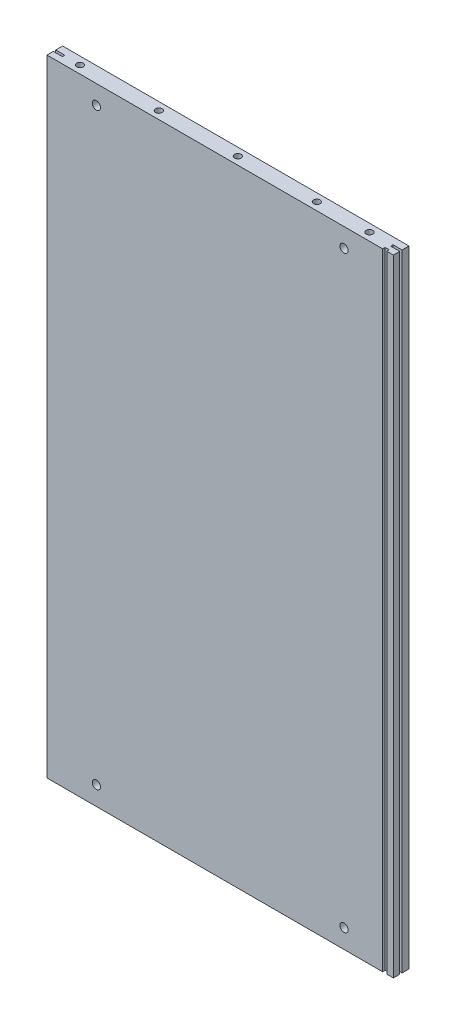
ISO-10303-21;
HEADER;
FILE_DESCRIPTION(('STEP AP214'),'2;1');
FILE_NAME('part.step','',(''),(''),'','','');
FILE_SCHEMA(('AUTOMOTIVE_DESIGN { 1 0 10303 214 1 1 1 1 }'));
ENDSEC;
DATA;
#1=APPLICATION_CONTEXT('core data for automotive mechanical design processes');
#2=APPLICATION_PROTOCOL_DEFINITION('international standard','automotive_design',2000,#1);
#3=PRODUCT_CONTEXT('',#1,'mechanical');
#4=PRODUCT('Part','Part','',(#3));
#5=PRODUCT_RELATED_PRODUCT_CATEGORY('part','',(#4));
#6=PRODUCT_DEFINITION_FORMATION('','',#4);
#7=PRODUCT_DEFINITION_CONTEXT('part definition',#1,'design');
#8=PRODUCT_DEFINITION('design','',#6,#7);
#9=PRODUCT_DEFINITION_SHAPE('','',#8);
#10=(LENGTH_UNIT() NAMED_UNIT(*) SI_UNIT(.MILLI.,.METRE.));
#11=(NAMED_UNIT(*) PLANE_ANGLE_UNIT() SI_UNIT($,.RADIAN.));
#12=(NAMED_UNIT(*) SI_UNIT($,.STERADIAN.) SOLID_ANGLE_UNIT());
#13=UNCERTAINTY_MEASURE_WITH_UNIT(LENGTH_MEASURE(1.E-05),#10,'distance_accuracy_value','');
#14=(GEOMETRIC_REPRESENTATION_CONTEXT(3) GLOBAL_UNCERTAINTY_ASSIGNED_CONTEXT((#13)) GLOBAL_UNIT_ASSIGNED_CONTEXT((#10,
#11,#12)) REPRESENTATION_CONTEXT('',''));
#15=CARTESIAN_POINT('',(0.,0.,0.));
#16=DIRECTION('',(0.,0.,1.));
#17=DIRECTION('',(1.,0.,0.));
#18=AXIS2_PLACEMENT_3D('',#15,#16,#17);
#19=CARTESIAN_POINT('',(-210.5,-380.5,19.));
#20=DIRECTION('',(1.,0.,0.));
#21=DIRECTION('',(0.,0.,-1.));
#22=AXIS2_PLACEMENT_3D('',#19,#20,#21);
#23=PLANE('',#22);
#24=DIRECTION('',(0.,0.,-1.));
#25=VECTOR('',#24,1.);
#26=CARTESIAN_POINT('',(-210.5,-380.5,19.));
#27=LINE('',#26,#25);
#28=CARTESIAN_POINT('',(-210.5,-380.5,8.4));
#29=VERTEX_POINT('',#28);
#30=CARTESIAN_POINT('',(-210.5,-380.5,0.));
#31=VERTEX_POINT('',#30);
#32=EDGE_CURVE('E190',#29,#31,#27,.T.);
#33=ORIENTED_EDGE('',*,*,#32,.F.);
#34=DIRECTION('',(0.,1.,0.));
#35=VECTOR('',#34,1.);
#36=CARTESIAN_POINT('',(-210.5,-380.5,8.4));
#37=LINE('',#36,#35);
#38=CARTESIAN_POINT('',(-210.5,380.5,8.4));
#39=VERTEX_POINT('',#38);
#40=EDGE_CURVE('E176',#29,#39,#37,.T.);
#41=ORIENTED_EDGE('',*,*,#40,.T.);
#42=DIRECTION('',(0.,0.,-1.));
#43=VECTOR('',#42,1.);
#44=CARTESIAN_POINT('',(-210.5,380.5,19.));
#45=LINE('',#44,#43);
#46=CARTESIAN_POINT('',(-210.5,380.5,0.));
#47=VERTEX_POINT('',#46);
#48=EDGE_CURVE('E203',#39,#47,#45,.T.);
#49=ORIENTED_EDGE('',*,*,#48,.T.);
#50=DIRECTION('',(0.,-1.,0.));
#51=VECTOR('',#50,1.);
#52=CARTESIAN_POINT('',(-210.5,-380.5,0.));
#53=LINE('',#52,#51);
#54=EDGE_CURVE('E197',#47,#31,#53,.T.);
#55=ORIENTED_EDGE('',*,*,#54,.T.);
#56=EDGE_LOOP('',(#33,#41,#49,#55));
#57=FACE_BOUND('',#56,.T.);
#58=ADVANCED_FACE('F33',(#57),#23,.F.);
#59=CARTESIAN_POINT('',(210.5,-380.5,19.));
#60=DIRECTION('',(-1.,0.,0.));
#61=DIRECTION('',(0.,0.,1.));
#62=AXIS2_PLACEMENT_3D('',#59,#60,#61);
#63=PLANE('',#62);
#64=DIRECTION('',(0.,0.,-1.));
#65=VECTOR('',#64,1.);
#66=CARTESIAN_POINT('',(210.5,-380.5,19.));
#67=LINE('',#66,#65);
#68=CARTESIAN_POINT('',(210.5,-380.5,19.));
#69=VERTEX_POINT('',#68);
#70=CARTESIAN_POINT('',(210.5,-380.5,11.3));
#71=VERTEX_POINT('',#70);
#72=EDGE_CURVE('E200',#69,#71,#67,.T.);
#73=ORIENTED_EDGE('',*,*,#72,.T.);
#74=DIRECTION('',(0.,1.,0.));
#75=VECTOR('',#74,1.);
#76=CARTESIAN_POINT('',(210.5,-380.5,11.3));
#77=LINE('',#76,#75);
#78=CARTESIAN_POINT('',(210.5,380.5,11.3));
#79=VERTEX_POINT('',#78);
#80=EDGE_CURVE('E354',#71,#79,#77,.T.);
#81=ORIENTED_EDGE('',*,*,#80,.T.);
#82=DIRECTION('',(0.,0.,-1.));
#83=VECTOR('',#82,1.);
#84=CARTESIAN_POINT('',(210.5,380.5,19.));
#85=LINE('',#84,#83);
#86=CARTESIAN_POINT('',(210.5,380.5,19.));
#87=VERTEX_POINT('',#86);
#88=EDGE_CURVE('E11',#87,#79,#85,.T.);
#89=ORIENTED_EDGE('',*,*,#88,.F.);
#90=DIRECTION('',(0.,1.,0.));
#91=VECTOR('',#90,1.);
#92=CARTESIAN_POINT('',(210.5,-380.5,19.));
#93=LINE('',#92,#91);
#94=EDGE_CURVE('E229',#69,#87,#93,.T.);
#95=ORIENTED_EDGE('',*,*,#94,.F.);
#96=EDGE_LOOP('',(#73,#81,#89,#95));
#97=FACE_BOUND('',#96,.T.);
#98=ADVANCED_FACE('F414',(#97),#63,.F.);
#99=CARTESIAN_POINT('',(0.,0.,19.));
#100=DIRECTION('',(0.,0.,-1.));
#101=DIRECTION('',(-1.,0.,0.));
#102=AXIS2_PLACEMENT_3D('',#99,#100,#101);
#103=PLANE('',#102);
#104=DIRECTION('',(-1.,0.,0.));
#105=VECTOR('',#104,1.);
#106=CARTESIAN_POINT('',(-210.5,380.5,19.));
#107=LINE('',#106,#105);
#108=CARTESIAN_POINT('',(202.5,380.5,19.));
#109=VERTEX_POINT('',#108);
#110=EDGE_CURVE('E239',#87,#109,#107,.T.);
#111=ORIENTED_EDGE('',*,*,#110,.T.);
#112=DIRECTION('',(0.,-1.,0.));
#113=VECTOR('',#112,1.);
#114=CARTESIAN_POINT('',(202.5,380.5,19.));
#115=LINE('',#114,#113);
#116=CARTESIAN_POINT('',(202.5,-380.5,19.));
#117=VERTEX_POINT('',#116);
#118=EDGE_CURVE('E232',#109,#117,#115,.T.);
#119=ORIENTED_EDGE('',*,*,#118,.T.);
#120=DIRECTION('',(1.,0.,0.));
#121=VECTOR('',#120,1.);
#122=CARTESIAN_POINT('',(-210.5,-380.5,19.));
#123=LINE('',#122,#121);
#124=EDGE_CURVE('E236',#117,#69,#123,.T.);
#125=ORIENTED_EDGE('',*,*,#124,.T.);
#126=ORIENTED_EDGE('',*,*,#94,.T.);
#127=EDGE_LOOP('',(#111,#119,#125,#126));
#128=FACE_BOUND('',#127,.T.);
#129=ADVANCED_FACE('F419',(#128),#103,.F.);
#130=CARTESIAN_POINT('',(210.5,380.5,8.4));
#131=VERTEX_POINT('',#130);
#132=CARTESIAN_POINT('',(210.5,380.5,0.));
#133=VERTEX_POINT('',#132);
#134=EDGE_CURVE('E41',#131,#133,#85,.T.);
#135=ORIENTED_EDGE('',*,*,#134,.F.);
#136=DIRECTION('',(0.,1.,0.));
#137=VECTOR('',#136,1.);
#138=CARTESIAN_POINT('',(210.5,-380.5,8.4));
#139=LINE('',#138,#137);
#140=CARTESIAN_POINT('',(210.5,-380.5,8.4));
#141=VERTEX_POINT('',#140);
#142=EDGE_CURVE('E355',#141,#131,#139,.T.);
#143=ORIENTED_EDGE('',*,*,#142,.F.);
#144=CARTESIAN_POINT('',(210.5,-380.5,0.));
#145=VERTEX_POINT('',#144);
#146=EDGE_CURVE('E205',#141,#145,#67,.T.);
#147=ORIENTED_EDGE('',*,*,#146,.T.);
#148=DIRECTION('',(0.,1.,0.));
#149=VECTOR('',#148,1.);
#150=CARTESIAN_POINT('',(210.5,-380.5,0.));
#151=LINE('',#150,#149);
#152=EDGE_CURVE('E224',#145,#133,#151,.T.);
#153=ORIENTED_EDGE('',*,*,#152,.T.);
#154=EDGE_LOOP('',(#135,#143,#147,#153));
#155=FACE_BOUND('',#154,.T.);
#156=ADVANCED_FACE('F35',(#155),#63,.F.);
#157=CARTESIAN_POINT('',(-210.5,380.5,19.));
#158=DIRECTION('',(0.,-1.,0.));
#159=DIRECTION('',(0.,0.,-1.));
#160=AXIS2_PLACEMENT_3D('',#157,#158,#159);
#161=PLANE('',#160);
#162=CARTESIAN_POINT('',(172.,380.5,9.5));
#163=DIRECTION('',(0.,1.,0.));
#164=DIRECTION('',(0.,0.,1.));
#165=AXIS2_PLACEMENT_3D('',#162,#163,#164);
#166=CIRCLE('',#165,3.99999999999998);
#167=CARTESIAN_POINT('',(172.,380.5,13.5));
#168=VERTEX_POINT('',#167);
#169=EDGE_CURVE('E327',#168,#168,#166,.T.);
#170=ORIENTED_EDGE('',*,*,#169,.F.);
#171=EDGE_LOOP('',(#170));
#172=FACE_BOUND('',#171,.T.);
#173=CARTESIAN_POINT('',(108.,380.5,9.5));
#174=DIRECTION('',(0.,1.,0.));
#175=DIRECTION('',(0.,0.,1.));
#176=AXIS2_PLACEMENT_3D('',#173,#174,#175);
#177=CIRCLE('',#176,3.99999999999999);
#178=CARTESIAN_POINT('',(108.,380.5,13.5));
#179=VERTEX_POINT('',#178);
#180=EDGE_CURVE('E321',#179,#179,#177,.T.);
#181=ORIENTED_EDGE('',*,*,#180,.F.);
#182=EDGE_LOOP('',(#181));
#183=FACE_BOUND('',#182,.T.);
#184=CARTESIAN_POINT('',(12.,380.5,9.5));
#185=DIRECTION('',(0.,1.,0.));
#186=DIRECTION('',(0.,0.,1.));
#187=AXIS2_PLACEMENT_3D('',#184,#185,#186);
#188=CIRCLE('',#187,3.99999999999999);
#189=CARTESIAN_POINT('',(12.,380.5,13.5));
#190=VERTEX_POINT('',#189);
#191=EDGE_CURVE('E315',#190,#190,#188,.T.);
#192=ORIENTED_EDGE('',*,*,#191,.F.);
#193=EDGE_LOOP('',(#192));
#194=FACE_BOUND('',#193,.T.);
#195=CARTESIAN_POINT('',(-84.,380.5,9.5));
#196=DIRECTION('',(0.,1.,0.));
#197=DIRECTION('',(0.,0.,1.));
#198=AXIS2_PLACEMENT_3D('',#195,#196,#197);
#199=CIRCLE('',#198,3.99999999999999);
#200=CARTESIAN_POINT('',(-84.,380.5,13.5));
#201=VERTEX_POINT('',#200);
#202=EDGE_CURVE('E309',#201,#201,#199,.T.);
#203=ORIENTED_EDGE('',*,*,#202,.F.);
#204=EDGE_LOOP('',(#203));
#205=FACE_BOUND('',#204,.T.);
#206=CARTESIAN_POINT('',(-180.,380.5,9.5));
#207=DIRECTION('',(0.,1.,0.));
#208=DIRECTION('',(0.,0.,1.));
#209=AXIS2_PLACEMENT_3D('',#206,#207,#208);
#210=CIRCLE('',#209,4.);
#211=CARTESIAN_POINT('',(-180.,380.5,13.5));
#212=VERTEX_POINT('',#211);
#213=EDGE_CURVE('E303',#212,#212,#210,.T.);
#214=ORIENTED_EDGE('',*,*,#213,.F.);
#215=EDGE_LOOP('',(#214));
#216=FACE_BOUND('',#215,.T.);
#217=ORIENTED_EDGE('',*,*,#48,.F.);
#218=DIRECTION('',(-1.,0.,0.));
#219=VECTOR('',#218,1.);
#220=CARTESIAN_POINT('',(-199.5,380.5,8.4));
#221=LINE('',#220,#219);
#222=CARTESIAN_POINT('',(-199.5,380.5,8.4));
#223=VERTEX_POINT('',#222);
#224=EDGE_CURVE('E181',#223,#39,#221,.T.);
#225=ORIENTED_EDGE('',*,*,#224,.F.);
#226=DIRECTION('',(0.,0.,-1.));
#227=VECTOR('',#226,1.);
#228=CARTESIAN_POINT('',(-199.5,380.5,11.3));
#229=LINE('',#228,#227);
#230=CARTESIAN_POINT('',(-199.5,380.5,11.3));
#231=VERTEX_POINT('',#230);
#232=EDGE_CURVE('E194',#231,#223,#229,.T.);
#233=ORIENTED_EDGE('',*,*,#232,.F.);
#234=DIRECTION('',(1.,0.,0.));
#235=VECTOR('',#234,1.);
#236=CARTESIAN_POINT('',(-210.5,380.5,11.3));
#237=LINE('',#236,#235);
#238=CARTESIAN_POINT('',(-210.5,380.5,11.3));
#239=VERTEX_POINT('',#238);
#240=EDGE_CURVE('E385',#239,#231,#237,.T.);
#241=ORIENTED_EDGE('',*,*,#240,.F.);
#242=CARTESIAN_POINT('',(-210.5,380.5,19.));
#243=VERTEX_POINT('',#242);
#244=EDGE_CURVE('E208',#243,#239,#45,.T.);
#245=ORIENTED_EDGE('',*,*,#244,.F.);
#246=CARTESIAN_POINT('',(197.5,380.5,19.));
#247=VERTEX_POINT('',#246);
#248=EDGE_CURVE('E242',#247,#243,#107,.T.);
#249=ORIENTED_EDGE('',*,*,#248,.F.);
#250=DIRECTION('',(0.,0.,-1.));
#251=VECTOR('',#250,1.);
#252=CARTESIAN_POINT('',(197.5,380.5,19.));
#253=LINE('',#252,#251);
#254=CARTESIAN_POINT('',(197.5,380.5,16.));
#255=VERTEX_POINT('',#254);
#256=EDGE_CURVE('E256',#247,#255,#253,.T.);
#257=ORIENTED_EDGE('',*,*,#256,.T.);
#258=DIRECTION('',(1.,0.,0.));
#259=VECTOR('',#258,1.);
#260=CARTESIAN_POINT('',(197.5,380.5,16.));
#261=LINE('',#260,#259);
#262=CARTESIAN_POINT('',(202.5,380.5,16.));
#263=VERTEX_POINT('',#262);
#264=EDGE_CURVE('E266',#255,#263,#261,.T.);
#265=ORIENTED_EDGE('',*,*,#264,.T.);
#266=DIRECTION('',(0.,0.,1.));
#267=VECTOR('',#266,1.);
#268=CARTESIAN_POINT('',(202.5,380.5,16.));
#269=LINE('',#268,#267);
#270=EDGE_CURVE('E248',#263,#109,#269,.T.);
#271=ORIENTED_EDGE('',*,*,#270,.T.);
#272=ORIENTED_EDGE('',*,*,#110,.F.);
#273=ORIENTED_EDGE('',*,*,#88,.T.);
#274=DIRECTION('',(1.,0.,0.));
#275=VECTOR('',#274,1.);
#276=CARTESIAN_POINT('',(210.5,380.5,11.3));
#277=LINE('',#276,#275);
#278=CARTESIAN_POINT('',(199.5,380.5,11.3));
#279=VERTEX_POINT('',#278);
#280=EDGE_CURVE('E364',#279,#79,#277,.T.);
#281=ORIENTED_EDGE('',*,*,#280,.F.);
#282=DIRECTION('',(0.,0.,1.));
#283=VECTOR('',#282,1.);
#284=CARTESIAN_POINT('',(199.5,380.5,11.3));
#285=LINE('',#284,#283);
#286=CARTESIAN_POINT('',(199.5,380.5,8.4));
#287=VERTEX_POINT('',#286);
#288=EDGE_CURVE('E367',#287,#279,#285,.T.);
#289=ORIENTED_EDGE('',*,*,#288,.F.);
#290=DIRECTION('',(-1.,0.,0.));
#291=VECTOR('',#290,1.);
#292=CARTESIAN_POINT('',(199.5,380.5,8.4));
#293=LINE('',#292,#291);
#294=EDGE_CURVE('E370',#131,#287,#293,.T.);
#295=ORIENTED_EDGE('',*,*,#294,.F.);
#296=ORIENTED_EDGE('',*,*,#134,.T.);
#297=DIRECTION('',(-1.,0.,0.));
#298=VECTOR('',#297,1.);
#299=CARTESIAN_POINT('',(-210.5,380.5,0.));
#300=LINE('',#299,#298);
#301=EDGE_CURVE('E217',#133,#47,#300,.T.);
#302=ORIENTED_EDGE('',*,*,#301,.T.);
#303=EDGE_LOOP('',(#217,#225,#233,#241,#245,#249,#257,#265,#271,#272,#273,#281,#289,#295,#296,#302));
#304=FACE_BOUND('',#303,.T.);
#305=ADVANCED_FACE('F218',(#172,#183,#194,#205,#216,#304),#161,.F.);
#306=ORIENTED_EDGE('',*,*,#244,.T.);
#307=DIRECTION('',(0.,1.,0.));
#308=VECTOR('',#307,1.);
#309=CARTESIAN_POINT('',(-210.5,-380.5,11.3));
#310=LINE('',#309,#308);
#311=CARTESIAN_POINT('',(-210.5,-380.5,11.3));
#312=VERTEX_POINT('',#311);
#313=EDGE_CURVE('E185',#312,#239,#310,.T.);
#314=ORIENTED_EDGE('',*,*,#313,.F.);
#315=CARTESIAN_POINT('',(-210.5,-380.5,19.));
#316=VERTEX_POINT('',#315);
#317=EDGE_CURVE('E199',#316,#312,#27,.T.);
#318=ORIENTED_EDGE('',*,*,#317,.F.);
#319=DIRECTION('',(0.,-1.,0.));
#320=VECTOR('',#319,1.);
#321=CARTESIAN_POINT('',(-210.5,-380.5,19.));
#322=LINE('',#321,#320);
#323=EDGE_CURVE('E237',#243,#316,#322,.T.);
#324=ORIENTED_EDGE('',*,*,#323,.F.);
#325=EDGE_LOOP('',(#306,#314,#318,#324));
#326=FACE_BOUND('',#325,.T.);
#327=ADVANCED_FACE('F395',(#326),#23,.F.);
#328=CARTESIAN_POINT('',(-210.5,-380.5,19.));
#329=DIRECTION('',(0.,1.,0.));
#330=DIRECTION('',(0.,0.,1.));
#331=AXIS2_PLACEMENT_3D('',#328,#329,#330);
#332=PLANE('',#331);
#333=CARTESIAN_POINT('',(172.,-380.5,9.5));
#334=DIRECTION('',(0.,-1.,0.));
#335=DIRECTION('',(0.,0.,-1.));
#336=AXIS2_PLACEMENT_3D('',#333,#334,#335);
#337=CIRCLE('',#336,3.99999999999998);
#338=CARTESIAN_POINT('',(172.,-380.5,5.50000000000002));
#339=VERTEX_POINT('',#338);
#340=EDGE_CURVE('E297',#339,#339,#337,.T.);
#341=ORIENTED_EDGE('',*,*,#340,.F.);
#342=EDGE_LOOP('',(#341));
#343=FACE_BOUND('',#342,.T.);
#344=CARTESIAN_POINT('',(108.,-380.5,9.5));
#345=DIRECTION('',(0.,-1.,0.));
#346=DIRECTION('',(0.,0.,-1.));
#347=AXIS2_PLACEMENT_3D('',#344,#345,#346);
#348=CIRCLE('',#347,3.99999999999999);
#349=CARTESIAN_POINT('',(108.,-380.5,5.50000000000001));
#350=VERTEX_POINT('',#349);
#351=EDGE_CURVE('E291',#350,#350,#348,.T.);
#352=ORIENTED_EDGE('',*,*,#351,.F.);
#353=EDGE_LOOP('',(#352));
#354=FACE_BOUND('',#353,.T.);
#355=CARTESIAN_POINT('',(12.,-380.5,9.5));
#356=DIRECTION('',(0.,-1.,0.));
#357=DIRECTION('',(0.,0.,-1.));
#358=AXIS2_PLACEMENT_3D('',#355,#356,#357);
#359=CIRCLE('',#358,3.99999999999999);
#360=CARTESIAN_POINT('',(12.,-380.5,5.50000000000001));
#361=VERTEX_POINT('',#360);
#362=EDGE_CURVE('E285',#361,#361,#359,.T.);
#363=ORIENTED_EDGE('',*,*,#362,.F.);
#364=EDGE_LOOP('',(#363));
#365=FACE_BOUND('',#364,.T.);
#366=CARTESIAN_POINT('',(-84.,-380.5,9.5));
#367=DIRECTION('',(0.,-1.,0.));
#368=DIRECTION('',(0.,0.,-1.));
#369=AXIS2_PLACEMENT_3D('',#366,#367,#368);
#370=CIRCLE('',#369,3.99999999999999);
#371=CARTESIAN_POINT('',(-84.,-380.5,5.50000000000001));
#372=VERTEX_POINT('',#371);
#373=EDGE_CURVE('E279',#372,#372,#370,.T.);
#374=ORIENTED_EDGE('',*,*,#373,.F.);
#375=EDGE_LOOP('',(#374));
#376=FACE_BOUND('',#375,.T.);
#377=CARTESIAN_POINT('',(-180.,-380.5,9.5));
#378=DIRECTION('',(0.,-1.,0.));
#379=DIRECTION('',(0.,0.,-1.));
#380=AXIS2_PLACEMENT_3D('',#377,#378,#379);
#381=CIRCLE('',#380,4.);
#382=CARTESIAN_POINT('',(-180.,-380.5,5.5));
#383=VERTEX_POINT('',#382);
#384=EDGE_CURVE('E273',#383,#383,#381,.T.);
#385=ORIENTED_EDGE('',*,*,#384,.F.);
#386=EDGE_LOOP('',(#385));
#387=FACE_BOUND('',#386,.T.);
#388=DIRECTION('',(0.,0.,-1.));
#389=VECTOR('',#388,1.);
#390=CARTESIAN_POINT('',(-199.5,-380.5,11.3));
#391=LINE('',#390,#389);
#392=CARTESIAN_POINT('',(-199.5,-380.5,11.3));
#393=VERTEX_POINT('',#392);
#394=CARTESIAN_POINT('',(-199.5,-380.5,8.4));
#395=VERTEX_POINT('',#394);
#396=EDGE_CURVE('E48',#393,#395,#391,.T.);
#397=ORIENTED_EDGE('',*,*,#396,.T.);
#398=DIRECTION('',(-1.,0.,0.));
#399=VECTOR('',#398,1.);
#400=CARTESIAN_POINT('',(-199.5,-380.5,8.4));
#401=LINE('',#400,#399);
#402=EDGE_CURVE('E179',#395,#29,#401,.T.);
#403=ORIENTED_EDGE('',*,*,#402,.T.);
#404=ORIENTED_EDGE('',*,*,#32,.T.);
#405=DIRECTION('',(1.,0.,0.));
#406=VECTOR('',#405,1.);
#407=CARTESIAN_POINT('',(-210.5,-380.5,0.));
#408=LINE('',#407,#406);
#409=EDGE_CURVE('E227',#31,#145,#408,.T.);
#410=ORIENTED_EDGE('',*,*,#409,.T.);
#411=ORIENTED_EDGE('',*,*,#146,.F.);
#412=DIRECTION('',(-1.,0.,0.));
#413=VECTOR('',#412,1.);
#414=CARTESIAN_POINT('',(199.5,-380.5,8.4));
#415=LINE('',#414,#413);
#416=CARTESIAN_POINT('',(199.5,-380.5,8.4));
#417=VERTEX_POINT('',#416);
#418=EDGE_CURVE('E366',#141,#417,#415,.T.);
#419=ORIENTED_EDGE('',*,*,#418,.T.);
#420=DIRECTION('',(0.,0.,1.));
#421=VECTOR('',#420,1.);
#422=CARTESIAN_POINT('',(199.5,-380.5,11.3));
#423=LINE('',#422,#421);
#424=CARTESIAN_POINT('',(199.5,-380.5,11.3));
#425=VERTEX_POINT('',#424);
#426=EDGE_CURVE('E56',#417,#425,#423,.T.);
#427=ORIENTED_EDGE('',*,*,#426,.T.);
#428=DIRECTION('',(1.,0.,0.));
#429=VECTOR('',#428,1.);
#430=CARTESIAN_POINT('',(210.5,-380.5,11.3));
#431=LINE('',#430,#429);
#432=EDGE_CURVE('E358',#425,#71,#431,.T.);
#433=ORIENTED_EDGE('',*,*,#432,.T.);
#434=ORIENTED_EDGE('',*,*,#72,.F.);
#435=ORIENTED_EDGE('',*,*,#124,.F.);
#436=DIRECTION('',(0.,0.,1.));
#437=VECTOR('',#436,1.);
#438=CARTESIAN_POINT('',(202.5,-380.5,16.));
#439=LINE('',#438,#437);
#440=CARTESIAN_POINT('',(202.5,-380.5,16.));
#441=VERTEX_POINT('',#440);
#442=EDGE_CURVE('E254',#441,#117,#439,.T.);
#443=ORIENTED_EDGE('',*,*,#442,.F.);
#444=DIRECTION('',(1.,0.,0.));
#445=VECTOR('',#444,1.);
#446=CARTESIAN_POINT('',(197.5,-380.5,16.));
#447=LINE('',#446,#445);
#448=CARTESIAN_POINT('',(197.5,-380.5,16.));
#449=VERTEX_POINT('',#448);
#450=EDGE_CURVE('E257',#449,#441,#447,.T.);
#451=ORIENTED_EDGE('',*,*,#450,.F.);
#452=DIRECTION('',(0.,0.,-1.));
#453=VECTOR('',#452,1.);
#454=CARTESIAN_POINT('',(197.5,-380.5,19.));
#455=LINE('',#454,#453);
#456=CARTESIAN_POINT('',(197.5,-380.5,19.));
#457=VERTEX_POINT('',#456);
#458=EDGE_CURVE('E260',#457,#449,#455,.T.);
#459=ORIENTED_EDGE('',*,*,#458,.F.);
#460=EDGE_CURVE('E233',#316,#457,#123,.T.);
#461=ORIENTED_EDGE('',*,*,#460,.F.);
#462=ORIENTED_EDGE('',*,*,#317,.T.);
#463=DIRECTION('',(1.,0.,0.));
#464=VECTOR('',#463,1.);
#465=CARTESIAN_POINT('',(-210.5,-380.5,11.3));
#466=LINE('',#465,#464);
#467=EDGE_CURVE('E193',#312,#393,#466,.T.);
#468=ORIENTED_EDGE('',*,*,#467,.T.);
#469=EDGE_LOOP('',(#397,#403,#404,#410,#411,#419,#427,#433,#434,#435,#443,#451,#459,#461,#462,#468));
#470=FACE_BOUND('',#469,.T.);
#471=ADVANCED_FACE('F188',(#343,#354,#365,#376,#387,#470),#332,.F.);
#472=CARTESIAN_POINT('',(-150.5,357.5,19.));
#473=DIRECTION('',(0.,0.,1.));
#474=DIRECTION('',(1.,0.,0.));
#475=AXIS2_PLACEMENT_3D('',#472,#473,#474);
#476=CIRCLE('',#475,4.99999999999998);
#477=CARTESIAN_POINT('',(-145.5,357.5,19.));
#478=VERTEX_POINT('',#477);
#479=EDGE_CURVE('E351',#478,#478,#476,.T.);
#480=ORIENTED_EDGE('',*,*,#479,.F.);
#481=EDGE_LOOP('',(#480));
#482=FACE_BOUND('',#481,.T.);
#483=CARTESIAN_POINT('',(150.5,357.5,19.));
#484=DIRECTION('',(0.,0.,1.));
#485=DIRECTION('',(1.,0.,0.));
#486=AXIS2_PLACEMENT_3D('',#483,#484,#485);
#487=CIRCLE('',#486,4.99999999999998);
#488=CARTESIAN_POINT('',(155.5,357.5,19.));
#489=VERTEX_POINT('',#488);
#490=EDGE_CURVE('E345',#489,#489,#487,.T.);
#491=ORIENTED_EDGE('',*,*,#490,.F.);
#492=EDGE_LOOP('',(#491));
#493=FACE_BOUND('',#492,.T.);
#494=CARTESIAN_POINT('',(150.5,-357.5,19.));
#495=DIRECTION('',(0.,0.,1.));
#496=DIRECTION('',(1.,0.,0.));
#497=AXIS2_PLACEMENT_3D('',#494,#495,#496);
#498=CIRCLE('',#497,4.99999999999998);
#499=CARTESIAN_POINT('',(155.5,-357.5,19.));
#500=VERTEX_POINT('',#499);
#501=EDGE_CURVE('E339',#500,#500,#498,.T.);
#502=ORIENTED_EDGE('',*,*,#501,.F.);
#503=EDGE_LOOP('',(#502));
#504=FACE_BOUND('',#503,.T.);
#505=CARTESIAN_POINT('',(-150.5,-357.5,19.));
#506=DIRECTION('',(0.,0.,1.));
#507=DIRECTION('',(1.,0.,0.));
#508=AXIS2_PLACEMENT_3D('',#505,#506,#507);
#509=CIRCLE('',#508,4.99999999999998);
#510=CARTESIAN_POINT('',(-145.5,-357.5,19.));
#511=VERTEX_POINT('',#510);
#512=EDGE_CURVE('E333',#511,#511,#509,.T.);
#513=ORIENTED_EDGE('',*,*,#512,.F.);
#514=EDGE_LOOP('',(#513));
#515=FACE_BOUND('',#514,.T.);
#516=ORIENTED_EDGE('',*,*,#460,.T.);
#517=DIRECTION('',(0.,-1.,0.));
#518=VECTOR('',#517,1.);
#519=CARTESIAN_POINT('',(197.5,380.5,19.));
#520=LINE('',#519,#518);
#521=EDGE_CURVE('E245',#247,#457,#520,.T.);
#522=ORIENTED_EDGE('',*,*,#521,.F.);
#523=ORIENTED_EDGE('',*,*,#248,.T.);
#524=ORIENTED_EDGE('',*,*,#323,.T.);
#525=EDGE_LOOP('',(#516,#522,#523,#524));
#526=FACE_BOUND('',#525,.T.);
#527=ADVANCED_FACE('F400',(#482,#493,#504,#515,#526),#103,.F.);
#528=CARTESIAN_POINT('',(0.,0.,0.));
#529=DIRECTION('',(0.,0.,-1.));
#530=DIRECTION('',(-1.,0.,0.));
#531=AXIS2_PLACEMENT_3D('',#528,#529,#530);
#532=PLANE('',#531);
#533=CARTESIAN_POINT('',(-150.5,357.5,0.));
#534=DIRECTION('',(0.,0.,1.));
#535=DIRECTION('',(1.,0.,0.));
#536=AXIS2_PLACEMENT_3D('',#533,#534,#535);
#537=CIRCLE('',#536,5.);
#538=CARTESIAN_POINT('',(-145.5,357.5,0.));
#539=VERTEX_POINT('',#538);
#540=EDGE_CURVE('E348',#539,#539,#537,.T.);
#541=ORIENTED_EDGE('',*,*,#540,.T.);
#542=EDGE_LOOP('',(#541));
#543=FACE_BOUND('',#542,.T.);
#544=CARTESIAN_POINT('',(150.5,357.5,0.));
#545=DIRECTION('',(0.,0.,1.));
#546=DIRECTION('',(1.,0.,0.));
#547=AXIS2_PLACEMENT_3D('',#544,#545,#546);
#548=CIRCLE('',#547,5.);
#549=CARTESIAN_POINT('',(155.5,357.5,0.));
#550=VERTEX_POINT('',#549);
#551=EDGE_CURVE('E342',#550,#550,#548,.T.);
#552=ORIENTED_EDGE('',*,*,#551,.T.);
#553=EDGE_LOOP('',(#552));
#554=FACE_BOUND('',#553,.T.);
#555=CARTESIAN_POINT('',(150.5,-357.5,0.));
#556=DIRECTION('',(0.,0.,1.));
#557=DIRECTION('',(1.,0.,0.));
#558=AXIS2_PLACEMENT_3D('',#555,#556,#557);
#559=CIRCLE('',#558,5.);
#560=CARTESIAN_POINT('',(155.5,-357.5,0.));
#561=VERTEX_POINT('',#560);
#562=EDGE_CURVE('E336',#561,#561,#559,.T.);
#563=ORIENTED_EDGE('',*,*,#562,.T.);
#564=EDGE_LOOP('',(#563));
#565=FACE_BOUND('',#564,.T.);
#566=CARTESIAN_POINT('',(-150.5,-357.5,0.));
#567=DIRECTION('',(0.,0.,1.));
#568=DIRECTION('',(1.,0.,0.));
#569=AXIS2_PLACEMENT_3D('',#566,#567,#568);
#570=CIRCLE('',#569,5.);
#571=CARTESIAN_POINT('',(-145.5,-357.5,0.));
#572=VERTEX_POINT('',#571);
#573=EDGE_CURVE('E330',#572,#572,#570,.T.);
#574=ORIENTED_EDGE('',*,*,#573,.T.);
#575=EDGE_LOOP('',(#574));
#576=FACE_BOUND('',#575,.T.);
#577=ORIENTED_EDGE('',*,*,#152,.F.);
#578=ORIENTED_EDGE('',*,*,#409,.F.);
#579=ORIENTED_EDGE('',*,*,#54,.F.);
#580=ORIENTED_EDGE('',*,*,#301,.F.);
#581=EDGE_LOOP('',(#577,#578,#579,#580));
#582=FACE_BOUND('',#581,.T.);
#583=ADVANCED_FACE('F226',(#543,#554,#565,#576,#582),#532,.T.);
#584=CARTESIAN_POINT('',(202.5,380.5,16.));
#585=DIRECTION('',(1.,0.,0.));
#586=DIRECTION('',(0.,0.,-1.));
#587=AXIS2_PLACEMENT_3D('',#584,#585,#586);
#588=PLANE('',#587);
#589=ORIENTED_EDGE('',*,*,#442,.T.);
#590=ORIENTED_EDGE('',*,*,#118,.F.);
#591=ORIENTED_EDGE('',*,*,#270,.F.);
#592=DIRECTION('',(0.,-1.,0.));
#593=VECTOR('',#592,1.);
#594=CARTESIAN_POINT('',(202.5,380.5,16.));
#595=LINE('',#594,#593);
#596=EDGE_CURVE('E250',#263,#441,#595,.T.);
#597=ORIENTED_EDGE('',*,*,#596,.T.);
#598=EDGE_LOOP('',(#589,#590,#591,#597));
#599=FACE_BOUND('',#598,.T.);
#600=ADVANCED_FACE('F502',(#599),#588,.F.);
#601=CARTESIAN_POINT('',(197.5,380.5,16.));
#602=DIRECTION('',(0.,0.,-1.));
#603=DIRECTION('',(-1.,0.,0.));
#604=AXIS2_PLACEMENT_3D('',#601,#602,#603);
#605=PLANE('',#604);
#606=ORIENTED_EDGE('',*,*,#450,.T.);
#607=ORIENTED_EDGE('',*,*,#596,.F.);
#608=ORIENTED_EDGE('',*,*,#264,.F.);
#609=DIRECTION('',(0.,-1.,0.));
#610=VECTOR('',#609,1.);
#611=CARTESIAN_POINT('',(197.5,380.5,16.));
#612=LINE('',#611,#610);
#613=EDGE_CURVE('E247',#255,#449,#612,.T.);
#614=ORIENTED_EDGE('',*,*,#613,.T.);
#615=EDGE_LOOP('',(#606,#607,#608,#614));
#616=FACE_BOUND('',#615,.T.);
#617=ADVANCED_FACE('F505',(#616),#605,.F.);
#618=CARTESIAN_POINT('',(197.5,380.5,19.));
#619=DIRECTION('',(-1.,0.,0.));
#620=DIRECTION('',(0.,0.,1.));
#621=AXIS2_PLACEMENT_3D('',#618,#619,#620);
#622=PLANE('',#621);
#623=ORIENTED_EDGE('',*,*,#458,.T.);
#624=ORIENTED_EDGE('',*,*,#613,.F.);
#625=ORIENTED_EDGE('',*,*,#256,.F.);
#626=ORIENTED_EDGE('',*,*,#521,.T.);
#627=EDGE_LOOP('',(#623,#624,#625,#626));
#628=FACE_BOUND('',#627,.T.);
#629=ADVANCED_FACE('F500',(#628),#622,.F.);
#630=CARTESIAN_POINT('',(-180.,-353.5,9.5));
#631=DIRECTION('',(0.,-1.,0.));
#632=DIRECTION('',(0.,0.,-1.));
#633=AXIS2_PLACEMENT_3D('',#630,#631,#632);
#634=CONICAL_SURFACE('',#633,3.99999999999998,1.02974425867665);
#635=CARTESIAN_POINT('',(-180.,-351.09655752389,9.5));
#636=VERTEX_POINT('',#635);
#637=VERTEX_LOOP('',#636);
#638=FACE_BOUND('',#637,.T.);
#639=CARTESIAN_POINT('',(-180.,-353.5,9.5));
#640=DIRECTION('',(0.,-1.,0.));
#641=DIRECTION('',(0.,0.,-1.));
#642=AXIS2_PLACEMENT_3D('',#639,#640,#641);
#643=CIRCLE('',#642,3.99999999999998);
#644=CARTESIAN_POINT('',(-180.,-353.5,5.50000000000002));
#645=VERTEX_POINT('',#644);
#646=EDGE_CURVE('E263',#645,#645,#643,.T.);
#647=ORIENTED_EDGE('',*,*,#646,.T.);
#648=EDGE_LOOP('',(#647));
#649=FACE_BOUND('',#648,.T.);
#650=ADVANCED_FACE('F496',(#638,#649),#634,.F.);
#651=CARTESIAN_POINT('',(-180.,-380.5,9.5));
#652=DIRECTION('',(0.,-1.,0.));
#653=DIRECTION('',(0.,0.,-1.));
#654=AXIS2_PLACEMENT_3D('',#651,#652,#653);
#655=CYLINDRICAL_SURFACE('',#654,3.99999999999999);
#656=ORIENTED_EDGE('',*,*,#646,.F.);
#657=EDGE_LOOP('',(#656));
#658=FACE_BOUND('',#657,.T.);
#659=ORIENTED_EDGE('',*,*,#384,.T.);
#660=EDGE_LOOP('',(#659));
#661=FACE_BOUND('',#660,.T.);
#662=ADVANCED_FACE('F492',(#658,#661),#655,.F.);
#663=CARTESIAN_POINT('',(-84.,-353.5,9.5));
#664=DIRECTION('',(0.,-1.,0.));
#665=DIRECTION('',(0.,0.,-1.));
#666=AXIS2_PLACEMENT_3D('',#663,#664,#665);
#667=CONICAL_SURFACE('',#666,3.99999999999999,1.02974425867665);
#668=CARTESIAN_POINT('',(-84.,-351.09655752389,9.5));
#669=VERTEX_POINT('',#668);
#670=VERTEX_LOOP('',#669);
#671=FACE_BOUND('',#670,.T.);
#672=CARTESIAN_POINT('',(-84.,-353.5,9.5));
#673=DIRECTION('',(0.,-1.,0.));
#674=DIRECTION('',(0.,0.,-1.));
#675=AXIS2_PLACEMENT_3D('',#672,#673,#674);
#676=CIRCLE('',#675,3.99999999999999);
#677=CARTESIAN_POINT('',(-84.,-353.5,5.50000000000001));
#678=VERTEX_POINT('',#677);
#679=EDGE_CURVE('E276',#678,#678,#676,.T.);
#680=ORIENTED_EDGE('',*,*,#679,.T.);
#681=EDGE_LOOP('',(#680));
#682=FACE_BOUND('',#681,.T.);
#683=ADVANCED_FACE('F488',(#671,#682),#667,.F.);
#684=CARTESIAN_POINT('',(-84.,-380.5,9.5));
#685=DIRECTION('',(0.,-1.,0.));
#686=DIRECTION('',(0.,0.,-1.));
#687=AXIS2_PLACEMENT_3D('',#684,#685,#686);
#688=CYLINDRICAL_SURFACE('',#687,3.99999999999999);
#689=ORIENTED_EDGE('',*,*,#679,.F.);
#690=EDGE_LOOP('',(#689));
#691=FACE_BOUND('',#690,.T.);
#692=ORIENTED_EDGE('',*,*,#373,.T.);
#693=EDGE_LOOP('',(#692));
#694=FACE_BOUND('',#693,.T.);
#695=ADVANCED_FACE('F484',(#691,#694),#688,.F.);
#696=CARTESIAN_POINT('',(12.,-353.5,9.5));
#697=DIRECTION('',(0.,-1.,0.));
#698=DIRECTION('',(0.,0.,-1.));
#699=AXIS2_PLACEMENT_3D('',#696,#697,#698);
#700=CONICAL_SURFACE('',#699,3.99999999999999,1.02974425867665);
#701=CARTESIAN_POINT('',(12.,-351.09655752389,9.5));
#702=VERTEX_POINT('',#701);
#703=VERTEX_LOOP('',#702);
#704=FACE_BOUND('',#703,.T.);
#705=CARTESIAN_POINT('',(12.,-353.5,9.5));
#706=DIRECTION('',(0.,-1.,0.));
#707=DIRECTION('',(0.,0.,-1.));
#708=AXIS2_PLACEMENT_3D('',#705,#706,#707);
#709=CIRCLE('',#708,3.99999999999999);
#710=CARTESIAN_POINT('',(12.,-353.5,5.50000000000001));
#711=VERTEX_POINT('',#710);
#712=EDGE_CURVE('E282',#711,#711,#709,.T.);
#713=ORIENTED_EDGE('',*,*,#712,.T.);
#714=EDGE_LOOP('',(#713));
#715=FACE_BOUND('',#714,.T.);
#716=ADVANCED_FACE('F480',(#704,#715),#700,.F.);
#717=CARTESIAN_POINT('',(12.,-380.5,9.5));
#718=DIRECTION('',(0.,-1.,0.));
#719=DIRECTION('',(0.,0.,-1.));
#720=AXIS2_PLACEMENT_3D('',#717,#718,#719);
#721=CYLINDRICAL_SURFACE('',#720,3.99999999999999);
#722=ORIENTED_EDGE('',*,*,#712,.F.);
#723=EDGE_LOOP('',(#722));
#724=FACE_BOUND('',#723,.T.);
#725=ORIENTED_EDGE('',*,*,#362,.T.);
#726=EDGE_LOOP('',(#725));
#727=FACE_BOUND('',#726,.T.);
#728=ADVANCED_FACE('F476',(#724,#727),#721,.F.);
#729=CARTESIAN_POINT('',(108.,-353.5,9.5));
#730=DIRECTION('',(0.,-1.,0.));
#731=DIRECTION('',(0.,0.,-1.));
#732=AXIS2_PLACEMENT_3D('',#729,#730,#731);
#733=CONICAL_SURFACE('',#732,3.99999999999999,1.02974425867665);
#734=CARTESIAN_POINT('',(108.,-351.09655752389,9.5));
#735=VERTEX_POINT('',#734);
#736=VERTEX_LOOP('',#735);
#737=FACE_BOUND('',#736,.T.);
#738=CARTESIAN_POINT('',(108.,-353.5,9.5));
#739=DIRECTION('',(0.,-1.,0.));
#740=DIRECTION('',(0.,0.,-1.));
#741=AXIS2_PLACEMENT_3D('',#738,#739,#740);
#742=CIRCLE('',#741,3.99999999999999);
#743=CARTESIAN_POINT('',(108.,-353.5,5.50000000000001));
#744=VERTEX_POINT('',#743);
#745=EDGE_CURVE('E288',#744,#744,#742,.T.);
#746=ORIENTED_EDGE('',*,*,#745,.T.);
#747=EDGE_LOOP('',(#746));
#748=FACE_BOUND('',#747,.T.);
#749=ADVANCED_FACE('F472',(#737,#748),#733,.F.);
#750=CARTESIAN_POINT('',(108.,-380.5,9.5));
#751=DIRECTION('',(0.,-1.,0.));
#752=DIRECTION('',(0.,0.,-1.));
#753=AXIS2_PLACEMENT_3D('',#750,#751,#752);
#754=CYLINDRICAL_SURFACE('',#753,3.99999999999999);
#755=ORIENTED_EDGE('',*,*,#745,.F.);
#756=EDGE_LOOP('',(#755));
#757=FACE_BOUND('',#756,.T.);
#758=ORIENTED_EDGE('',*,*,#351,.T.);
#759=EDGE_LOOP('',(#758));
#760=FACE_BOUND('',#759,.T.);
#761=ADVANCED_FACE('F468',(#757,#760),#754,.F.);
#762=CARTESIAN_POINT('',(172.,-353.5,9.5));
#763=DIRECTION('',(0.,-1.,0.));
#764=DIRECTION('',(0.,0.,-1.));
#765=AXIS2_PLACEMENT_3D('',#762,#763,#764);
#766=CONICAL_SURFACE('',#765,3.99999999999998,1.02974425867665);
#767=CARTESIAN_POINT('',(172.,-351.09655752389,9.5));
#768=VERTEX_POINT('',#767);
#769=VERTEX_LOOP('',#768);
#770=FACE_BOUND('',#769,.T.);
#771=CARTESIAN_POINT('',(172.,-353.5,9.5));
#772=DIRECTION('',(0.,-1.,0.));
#773=DIRECTION('',(0.,0.,-1.));
#774=AXIS2_PLACEMENT_3D('',#771,#772,#773);
#775=CIRCLE('',#774,3.99999999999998);
#776=CARTESIAN_POINT('',(172.,-353.5,5.50000000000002));
#777=VERTEX_POINT('',#776);
#778=EDGE_CURVE('E294',#777,#777,#775,.T.);
#779=ORIENTED_EDGE('',*,*,#778,.T.);
#780=EDGE_LOOP('',(#779));
#781=FACE_BOUND('',#780,.T.);
#782=ADVANCED_FACE('F464',(#770,#781),#766,.F.);
#783=CARTESIAN_POINT('',(172.,-380.5,9.5));
#784=DIRECTION('',(0.,-1.,0.));
#785=DIRECTION('',(0.,0.,-1.));
#786=AXIS2_PLACEMENT_3D('',#783,#784,#785);
#787=CYLINDRICAL_SURFACE('',#786,3.99999999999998);
#788=ORIENTED_EDGE('',*,*,#778,.F.);
#789=EDGE_LOOP('',(#788));
#790=FACE_BOUND('',#789,.T.);
#791=ORIENTED_EDGE('',*,*,#340,.T.);
#792=EDGE_LOOP('',(#791));
#793=FACE_BOUND('',#792,.T.);
#794=ADVANCED_FACE('F456',(#790,#793),#787,.F.);
#795=CARTESIAN_POINT('',(-180.,353.5,9.5));
#796=DIRECTION('',(0.,1.,0.));
#797=DIRECTION('',(0.,0.,1.));
#798=AXIS2_PLACEMENT_3D('',#795,#796,#797);
#799=CONICAL_SURFACE('',#798,3.99999999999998,1.02974425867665);
#800=CARTESIAN_POINT('',(-180.,351.09655752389,9.5));
#801=VERTEX_POINT('',#800);
#802=VERTEX_LOOP('',#801);
#803=FACE_BOUND('',#802,.T.);
#804=CARTESIAN_POINT('',(-180.,353.5,9.5));
#805=DIRECTION('',(0.,1.,0.));
#806=DIRECTION('',(0.,0.,1.));
#807=AXIS2_PLACEMENT_3D('',#804,#805,#806);
#808=CIRCLE('',#807,3.99999999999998);
#809=CARTESIAN_POINT('',(-180.,353.5,13.5));
#810=VERTEX_POINT('',#809);
#811=EDGE_CURVE('E300',#810,#810,#808,.T.);
#812=ORIENTED_EDGE('',*,*,#811,.T.);
#813=EDGE_LOOP('',(#812));
#814=FACE_BOUND('',#813,.T.);
#815=ADVANCED_FACE('F446',(#803,#814),#799,.F.);
#816=CARTESIAN_POINT('',(-180.,380.5,9.5));
#817=DIRECTION('',(0.,1.,0.));
#818=DIRECTION('',(0.,0.,1.));
#819=AXIS2_PLACEMENT_3D('',#816,#817,#818);
#820=CYLINDRICAL_SURFACE('',#819,3.99999999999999);
#821=ORIENTED_EDGE('',*,*,#811,.F.);
#822=EDGE_LOOP('',(#821));
#823=FACE_BOUND('',#822,.T.);
#824=ORIENTED_EDGE('',*,*,#213,.T.);
#825=EDGE_LOOP('',(#824));
#826=FACE_BOUND('',#825,.T.);
#827=ADVANCED_FACE('F443',(#823,#826),#820,.F.);
#828=CARTESIAN_POINT('',(-84.,353.5,9.5));
#829=DIRECTION('',(0.,1.,0.));
#830=DIRECTION('',(0.,0.,1.));
#831=AXIS2_PLACEMENT_3D('',#828,#829,#830);
#832=CONICAL_SURFACE('',#831,3.99999999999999,1.02974425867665);
#833=CARTESIAN_POINT('',(-84.,351.09655752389,9.5));
#834=VERTEX_POINT('',#833);
#835=VERTEX_LOOP('',#834);
#836=FACE_BOUND('',#835,.T.);
#837=CARTESIAN_POINT('',(-84.,353.5,9.5));
#838=DIRECTION('',(0.,1.,0.));
#839=DIRECTION('',(0.,0.,1.));
#840=AXIS2_PLACEMENT_3D('',#837,#838,#839);
#841=CIRCLE('',#840,3.99999999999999);
#842=CARTESIAN_POINT('',(-84.,353.5,13.5));
#843=VERTEX_POINT('',#842);
#844=EDGE_CURVE('E306',#843,#843,#841,.T.);
#845=ORIENTED_EDGE('',*,*,#844,.T.);
#846=EDGE_LOOP('',(#845));
#847=FACE_BOUND('',#846,.T.);
#848=ADVANCED_FACE('F445',(#836,#847),#832,.F.);
#849=CARTESIAN_POINT('',(-84.,380.5,9.5));
#850=DIRECTION('',(0.,1.,0.));
#851=DIRECTION('',(0.,0.,1.));
#852=AXIS2_PLACEMENT_3D('',#849,#850,#851);
#853=CYLINDRICAL_SURFACE('',#852,3.99999999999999);
#854=ORIENTED_EDGE('',*,*,#844,.F.);
#855=EDGE_LOOP('',(#854));
#856=FACE_BOUND('',#855,.T.);
#857=ORIENTED_EDGE('',*,*,#202,.T.);
#858=EDGE_LOOP('',(#857));
#859=FACE_BOUND('',#858,.T.);
#860=ADVANCED_FACE('F453',(#856,#859),#853,.F.);
#861=CARTESIAN_POINT('',(12.,353.5,9.5));
#862=DIRECTION('',(0.,1.,0.));
#863=DIRECTION('',(0.,0.,1.));
#864=AXIS2_PLACEMENT_3D('',#861,#862,#863);
#865=CONICAL_SURFACE('',#864,3.99999999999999,1.02974425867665);
#866=CARTESIAN_POINT('',(12.,351.09655752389,9.5));
#867=VERTEX_POINT('',#866);
#868=VERTEX_LOOP('',#867);
#869=FACE_BOUND('',#868,.T.);
#870=CARTESIAN_POINT('',(12.,353.5,9.5));
#871=DIRECTION('',(0.,1.,0.));
#872=DIRECTION('',(0.,0.,1.));
#873=AXIS2_PLACEMENT_3D('',#870,#871,#872);
#874=CIRCLE('',#873,3.99999999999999);
#875=CARTESIAN_POINT('',(12.,353.5,13.5));
#876=VERTEX_POINT('',#875);
#877=EDGE_CURVE('E312',#876,#876,#874,.T.);
#878=ORIENTED_EDGE('',*,*,#877,.T.);
#879=EDGE_LOOP('',(#878));
#880=FACE_BOUND('',#879,.T.);
#881=ADVANCED_FACE('F562',(#869,#880),#865,.F.);
#882=CARTESIAN_POINT('',(12.,380.5,9.5));
#883=DIRECTION('',(0.,1.,0.));
#884=DIRECTION('',(0.,0.,1.));
#885=AXIS2_PLACEMENT_3D('',#882,#883,#884);
#886=CYLINDRICAL_SURFACE('',#885,3.99999999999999);
#887=ORIENTED_EDGE('',*,*,#877,.F.);
#888=EDGE_LOOP('',(#887));
#889=FACE_BOUND('',#888,.T.);
#890=ORIENTED_EDGE('',*,*,#191,.T.);
#891=EDGE_LOOP('',(#890));
#892=FACE_BOUND('',#891,.T.);
#893=ADVANCED_FACE('F558',(#889,#892),#886,.F.);
#894=CARTESIAN_POINT('',(108.,353.5,9.5));
#895=DIRECTION('',(0.,1.,0.));
#896=DIRECTION('',(0.,0.,1.));
#897=AXIS2_PLACEMENT_3D('',#894,#895,#896);
#898=CONICAL_SURFACE('',#897,3.99999999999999,1.02974425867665);
#899=CARTESIAN_POINT('',(108.,351.09655752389,9.5));
#900=VERTEX_POINT('',#899);
#901=VERTEX_LOOP('',#900);
#902=FACE_BOUND('',#901,.T.);
#903=CARTESIAN_POINT('',(108.,353.5,9.5));
#904=DIRECTION('',(0.,1.,0.));
#905=DIRECTION('',(0.,0.,1.));
#906=AXIS2_PLACEMENT_3D('',#903,#904,#905);
#907=CIRCLE('',#906,3.99999999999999);
#908=CARTESIAN_POINT('',(108.,353.5,13.5));
#909=VERTEX_POINT('',#908);
#910=EDGE_CURVE('E318',#909,#909,#907,.T.);
#911=ORIENTED_EDGE('',*,*,#910,.T.);
#912=EDGE_LOOP('',(#911));
#913=FACE_BOUND('',#912,.T.);
#914=ADVANCED_FACE('F554',(#902,#913),#898,.F.);
#915=CARTESIAN_POINT('',(108.,380.5,9.5));
#916=DIRECTION('',(0.,1.,0.));
#917=DIRECTION('',(0.,0.,1.));
#918=AXIS2_PLACEMENT_3D('',#915,#916,#917);
#919=CYLINDRICAL_SURFACE('',#918,3.99999999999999);
#920=ORIENTED_EDGE('',*,*,#910,.F.);
#921=EDGE_LOOP('',(#920));
#922=FACE_BOUND('',#921,.T.);
#923=ORIENTED_EDGE('',*,*,#180,.T.);
#924=EDGE_LOOP('',(#923));
#925=FACE_BOUND('',#924,.T.);
#926=ADVANCED_FACE('F550',(#922,#925),#919,.F.);
#927=CARTESIAN_POINT('',(172.,353.5,9.5));
#928=DIRECTION('',(0.,1.,0.));
#929=DIRECTION('',(0.,0.,1.));
#930=AXIS2_PLACEMENT_3D('',#927,#928,#929);
#931=CONICAL_SURFACE('',#930,3.99999999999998,1.02974425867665);
#932=CARTESIAN_POINT('',(172.,351.09655752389,9.5));
#933=VERTEX_POINT('',#932);
#934=VERTEX_LOOP('',#933);
#935=FACE_BOUND('',#934,.T.);
#936=CARTESIAN_POINT('',(172.,353.5,9.5));
#937=DIRECTION('',(0.,1.,0.));
#938=DIRECTION('',(0.,0.,1.));
#939=AXIS2_PLACEMENT_3D('',#936,#937,#938);
#940=CIRCLE('',#939,3.99999999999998);
#941=CARTESIAN_POINT('',(172.,353.5,13.5));
#942=VERTEX_POINT('',#941);
#943=EDGE_CURVE('E324',#942,#942,#940,.T.);
#944=ORIENTED_EDGE('',*,*,#943,.T.);
#945=EDGE_LOOP('',(#944));
#946=FACE_BOUND('',#945,.T.);
#947=ADVANCED_FACE('F543',(#935,#946),#931,.F.);
#948=CARTESIAN_POINT('',(172.,380.5,9.5));
#949=DIRECTION('',(0.,1.,0.));
#950=DIRECTION('',(0.,0.,1.));
#951=AXIS2_PLACEMENT_3D('',#948,#949,#950);
#952=CYLINDRICAL_SURFACE('',#951,3.99999999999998);
#953=ORIENTED_EDGE('',*,*,#943,.F.);
#954=EDGE_LOOP('',(#953));
#955=FACE_BOUND('',#954,.T.);
#956=ORIENTED_EDGE('',*,*,#169,.T.);
#957=EDGE_LOOP('',(#956));
#958=FACE_BOUND('',#957,.T.);
#959=ADVANCED_FACE('F532',(#955,#958),#952,.F.);
#960=CARTESIAN_POINT('',(-150.5,-357.5,19.));
#961=DIRECTION('',(0.,0.,1.));
#962=DIRECTION('',(1.,0.,0.));
#963=AXIS2_PLACEMENT_3D('',#960,#961,#962);
#964=CYLINDRICAL_SURFACE('',#963,4.99999999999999);
#965=ORIENTED_EDGE('',*,*,#573,.F.);
#966=EDGE_LOOP('',(#965));
#967=FACE_BOUND('',#966,.T.);
#968=ORIENTED_EDGE('',*,*,#512,.T.);
#969=EDGE_LOOP('',(#968));
#970=FACE_BOUND('',#969,.T.);
#971=ADVANCED_FACE('F528',(#967,#970),#964,.F.);
#972=CARTESIAN_POINT('',(150.5,-357.5,19.));
#973=DIRECTION('',(0.,0.,1.));
#974=DIRECTION('',(1.,0.,0.));
#975=AXIS2_PLACEMENT_3D('',#972,#973,#974);
#976=CYLINDRICAL_SURFACE('',#975,4.99999999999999);
#977=ORIENTED_EDGE('',*,*,#562,.F.);
#978=EDGE_LOOP('',(#977));
#979=FACE_BOUND('',#978,.T.);
#980=ORIENTED_EDGE('',*,*,#501,.T.);
#981=EDGE_LOOP('',(#980));
#982=FACE_BOUND('',#981,.T.);
#983=ADVANCED_FACE('F531',(#979,#982),#976,.F.);
#984=CARTESIAN_POINT('',(150.5,357.5,19.));
#985=DIRECTION('',(0.,0.,1.));
#986=DIRECTION('',(1.,0.,0.));
#987=AXIS2_PLACEMENT_3D('',#984,#985,#986);
#988=CYLINDRICAL_SURFACE('',#987,4.99999999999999);
#989=ORIENTED_EDGE('',*,*,#551,.F.);
#990=EDGE_LOOP('',(#989));
#991=FACE_BOUND('',#990,.T.);
#992=ORIENTED_EDGE('',*,*,#490,.T.);
#993=EDGE_LOOP('',(#992));
#994=FACE_BOUND('',#993,.T.);
#995=ADVANCED_FACE('F540',(#991,#994),#988,.F.);
#996=CARTESIAN_POINT('',(-150.5,357.5,19.));
#997=DIRECTION('',(0.,0.,1.));
#998=DIRECTION('',(1.,0.,0.));
#999=AXIS2_PLACEMENT_3D('',#996,#997,#998);
#1000=CYLINDRICAL_SURFACE('',#999,4.99999999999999);
#1001=ORIENTED_EDGE('',*,*,#540,.F.);
#1002=EDGE_LOOP('',(#1001));
#1003=FACE_BOUND('',#1002,.T.);
#1004=ORIENTED_EDGE('',*,*,#479,.T.);
#1005=EDGE_LOOP('',(#1004));
#1006=FACE_BOUND('',#1005,.T.);
#1007=ADVANCED_FACE('F630',(#1003,#1006),#1000,.F.);
#1008=CARTESIAN_POINT('',(210.5,-380.5,11.3));
#1009=DIRECTION('',(0.,0.,1.));
#1010=DIRECTION('',(1.,0.,0.));
#1011=AXIS2_PLACEMENT_3D('',#1008,#1009,#1010);
#1012=PLANE('',#1011);
#1013=ORIENTED_EDGE('',*,*,#280,.T.);
#1014=ORIENTED_EDGE('',*,*,#80,.F.);
#1015=ORIENTED_EDGE('',*,*,#432,.F.);
#1016=DIRECTION('',(0.,1.,0.));
#1017=VECTOR('',#1016,1.);
#1018=CARTESIAN_POINT('',(199.5,-380.5,11.3));
#1019=LINE('',#1018,#1017);
#1020=EDGE_CURVE('E360',#425,#279,#1019,.T.);
#1021=ORIENTED_EDGE('',*,*,#1020,.T.);
#1022=EDGE_LOOP('',(#1013,#1014,#1015,#1021));
#1023=FACE_BOUND('',#1022,.T.);
#1024=ADVANCED_FACE('F638',(#1023),#1012,.F.);
#1025=CARTESIAN_POINT('',(199.5,-380.5,11.3));
#1026=DIRECTION('',(-1.,0.,0.));
#1027=DIRECTION('',(0.,0.,1.));
#1028=AXIS2_PLACEMENT_3D('',#1025,#1026,#1027);
#1029=PLANE('',#1028);
#1030=ORIENTED_EDGE('',*,*,#288,.T.);
#1031=ORIENTED_EDGE('',*,*,#1020,.F.);
#1032=ORIENTED_EDGE('',*,*,#426,.F.);
#1033=DIRECTION('',(0.,1.,0.));
#1034=VECTOR('',#1033,1.);
#1035=CARTESIAN_POINT('',(199.5,-380.5,8.4));
#1036=LINE('',#1035,#1034);
#1037=EDGE_CURVE('E357',#417,#287,#1036,.T.);
#1038=ORIENTED_EDGE('',*,*,#1037,.T.);
#1039=EDGE_LOOP('',(#1030,#1031,#1032,#1038));
#1040=FACE_BOUND('',#1039,.T.);
#1041=ADVANCED_FACE('F679',(#1040),#1029,.F.);
#1042=CARTESIAN_POINT('',(199.5,-380.5,8.4));
#1043=DIRECTION('',(0.,0.,-1.));
#1044=DIRECTION('',(-1.,0.,0.));
#1045=AXIS2_PLACEMENT_3D('',#1042,#1043,#1044);
#1046=PLANE('',#1045);
#1047=ORIENTED_EDGE('',*,*,#294,.T.);
#1048=ORIENTED_EDGE('',*,*,#1037,.F.);
#1049=ORIENTED_EDGE('',*,*,#418,.F.);
#1050=ORIENTED_EDGE('',*,*,#142,.T.);
#1051=EDGE_LOOP('',(#1047,#1048,#1049,#1050));
#1052=FACE_BOUND('',#1051,.T.);
#1053=ADVANCED_FACE('F411',(#1052),#1046,.F.);
#1054=CARTESIAN_POINT('',(-199.5,-380.5,8.4));
#1055=DIRECTION('',(0.,0.,-1.));
#1056=DIRECTION('',(-1.,0.,0.));
#1057=AXIS2_PLACEMENT_3D('',#1054,#1055,#1056);
#1058=PLANE('',#1057);
#1059=ORIENTED_EDGE('',*,*,#224,.T.);
#1060=ORIENTED_EDGE('',*,*,#40,.F.);
#1061=ORIENTED_EDGE('',*,*,#402,.F.);
#1062=DIRECTION('',(0.,1.,0.));
#1063=VECTOR('',#1062,1.);
#1064=CARTESIAN_POINT('',(-199.5,-380.5,8.4));
#1065=LINE('',#1064,#1063);
#1066=EDGE_CURVE('E373',#395,#223,#1065,.T.);
#1067=ORIENTED_EDGE('',*,*,#1066,.T.);
#1068=EDGE_LOOP('',(#1059,#1060,#1061,#1067));
#1069=FACE_BOUND('',#1068,.T.);
#1070=ADVANCED_FACE('F178',(#1069),#1058,.F.);
#1071=CARTESIAN_POINT('',(-199.5,-380.5,11.3));
#1072=DIRECTION('',(1.,0.,0.));
#1073=DIRECTION('',(0.,0.,-1.));
#1074=AXIS2_PLACEMENT_3D('',#1071,#1072,#1073);
#1075=PLANE('',#1074);
#1076=ORIENTED_EDGE('',*,*,#232,.T.);
#1077=ORIENTED_EDGE('',*,*,#1066,.F.);
#1078=ORIENTED_EDGE('',*,*,#396,.F.);
#1079=DIRECTION('',(0.,1.,0.));
#1080=VECTOR('',#1079,1.);
#1081=CARTESIAN_POINT('',(-199.5,-380.5,11.3));
#1082=LINE('',#1081,#1080);
#1083=EDGE_CURVE('E380',#393,#231,#1082,.T.);
#1084=ORIENTED_EDGE('',*,*,#1083,.T.);
#1085=EDGE_LOOP('',(#1076,#1077,#1078,#1084));
#1086=FACE_BOUND('',#1085,.T.);
#1087=ADVANCED_FACE('F403',(#1086),#1075,.F.);
#1088=CARTESIAN_POINT('',(-210.5,-380.5,11.3));
#1089=DIRECTION('',(0.,0.,1.));
#1090=DIRECTION('',(1.,0.,0.));
#1091=AXIS2_PLACEMENT_3D('',#1088,#1089,#1090);
#1092=PLANE('',#1091);
#1093=ORIENTED_EDGE('',*,*,#240,.T.);
#1094=ORIENTED_EDGE('',*,*,#1083,.F.);
#1095=ORIENTED_EDGE('',*,*,#467,.F.);
#1096=ORIENTED_EDGE('',*,*,#313,.T.);
#1097=EDGE_LOOP('',(#1093,#1094,#1095,#1096));
#1098=FACE_BOUND('',#1097,.T.);
#1099=ADVANCED_FACE('F393',(#1098),#1092,.F.);
#1100=CLOSED_SHELL('',(#58,#98,#129,#156,#305,#327,#471,#527,#583,#600,#617,#629,#650,#662,#683,
#695,#716,#728,#749,#761,#782,#794,#815,#827,#848,#860,#881,#893,#914,#926,#947,#959,#971,#983,
#995,#1007,#1024,#1041,#1053,#1070,#1087,#1099));
#1101=MANIFOLD_SOLID_BREP('B2',#1100);
#1102=ADVANCED_BREP_SHAPE_REPRESENTATION('',(#18,#1101),#14);
#1103=SHAPE_DEFINITION_REPRESENTATION(#9,#1102);
ENDSEC;
END-ISO-10303-21;
